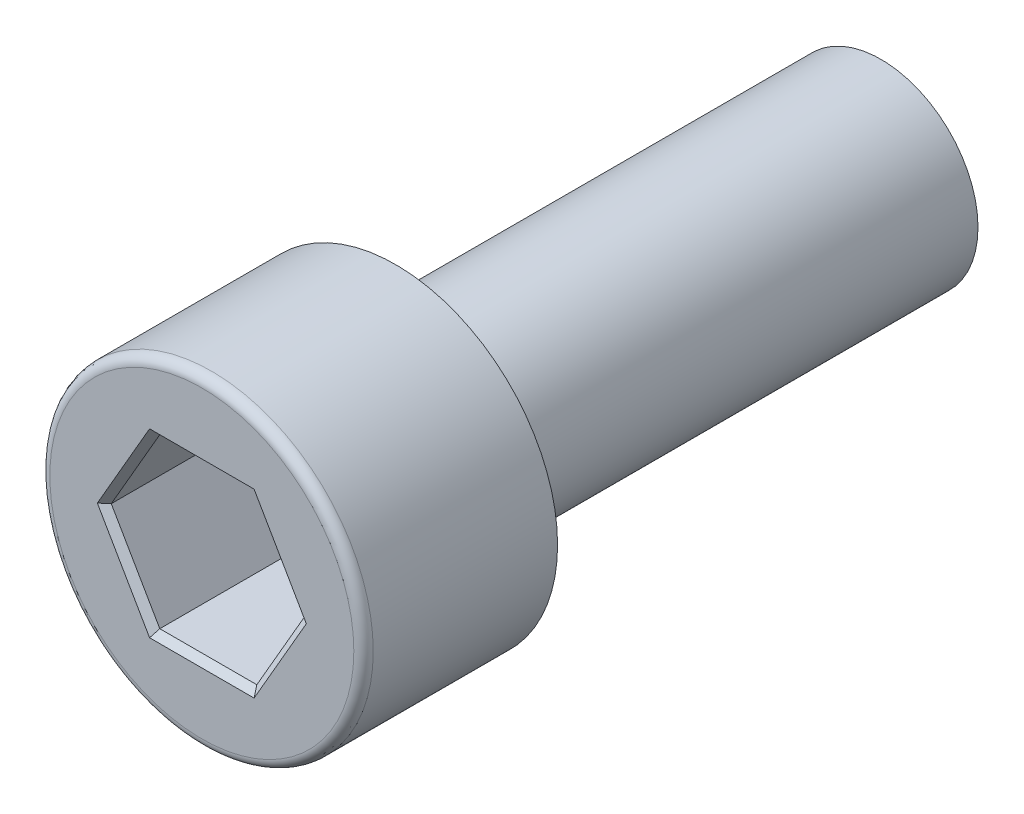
ISO-10303-21;
HEADER;
FILE_DESCRIPTION(('STEP AP214'),'2;1');
FILE_NAME('part.step','',(''),(''),'','','');
FILE_SCHEMA(('AUTOMOTIVE_DESIGN { 1 0 10303 214 1 1 1 1 }'));
ENDSEC;
DATA;
#1=APPLICATION_CONTEXT('core data for automotive mechanical design processes');
#2=APPLICATION_PROTOCOL_DEFINITION('international standard','automotive_design',2000,#1);
#3=PRODUCT_CONTEXT('',#1,'mechanical');
#4=PRODUCT('Part','Part','',(#3));
#5=PRODUCT_RELATED_PRODUCT_CATEGORY('part','',(#4));
#6=PRODUCT_DEFINITION_FORMATION('','',#4);
#7=PRODUCT_DEFINITION_CONTEXT('part definition',#1,'design');
#8=PRODUCT_DEFINITION('design','',#6,#7);
#9=PRODUCT_DEFINITION_SHAPE('','',#8);
#10=(LENGTH_UNIT() NAMED_UNIT(*) SI_UNIT(.MILLI.,.METRE.));
#11=(NAMED_UNIT(*) PLANE_ANGLE_UNIT() SI_UNIT($,.RADIAN.));
#12=(NAMED_UNIT(*) SI_UNIT($,.STERADIAN.) SOLID_ANGLE_UNIT());
#13=UNCERTAINTY_MEASURE_WITH_UNIT(LENGTH_MEASURE(1.E-05),#10,'distance_accuracy_value','');
#14=(GEOMETRIC_REPRESENTATION_CONTEXT(3) GLOBAL_UNCERTAINTY_ASSIGNED_CONTEXT((#13)) GLOBAL_UNIT_ASSIGNED_CONTEXT((#10,
#11,#12)) REPRESENTATION_CONTEXT('',''));
#15=CARTESIAN_POINT('',(0.,0.,0.));
#16=DIRECTION('',(0.,0.,1.));
#17=DIRECTION('',(1.,0.,0.));
#18=AXIS2_PLACEMENT_3D('',#15,#16,#17);
#19=CARTESIAN_POINT('',(0.,0.,21.));
#20=DIRECTION('',(0.,0.,1.));
#21=DIRECTION('',(1.,0.,0.));
#22=AXIS2_PLACEMENT_3D('',#19,#20,#21);
#23=PLANE('',#22);
#24=CARTESIAN_POINT('',(0.,0.,21.));
#25=DIRECTION('',(0.,0.,1.));
#26=DIRECTION('',(1.,0.,0.));
#27=AXIS2_PLACEMENT_3D('',#24,#25,#26);
#28=CIRCLE('',#27,4.7);
#29=CARTESIAN_POINT('',(4.7,0.,21.));
#30=VERTEX_POINT('',#29);
#31=EDGE_CURVE('E42',#30,#30,#28,.T.);
#32=ORIENTED_EDGE('',*,*,#31,.T.);
#33=EDGE_LOOP('',(#32));
#34=FACE_BOUND('',#33,.T.);
#35=DIRECTION('',(-0.49998194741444,0.8660358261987,0.));
#36=VECTOR('',#35,1.);
#37=CARTESIAN_POINT('',(-2.42326132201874,-1.39900322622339,21.));
#38=LINE('',#37,#36);
#39=CARTESIAN_POINT('',(-1.61558114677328,-2.798013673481,21.));
#40=VERTEX_POINT('',#39);
#41=CARTESIAN_POINT('',(-3.23093732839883,0.,21.));
#42=VERTEX_POINT('',#41);
#43=EDGE_CURVE('E161',#40,#42,#38,.T.);
#44=ORIENTED_EDGE('',*,*,#43,.T.);
#45=DIRECTION('',(0.499981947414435,0.866035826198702,0.));
#46=VECTOR('',#45,1.);
#47=CARTESIAN_POINT('',(-2.42326132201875,1.39900322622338,21.));
#48=LINE('',#47,#46);
#49=CARTESIAN_POINT('',(-1.61558114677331,2.79801367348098,21.));
#50=VERTEX_POINT('',#49);
#51=EDGE_CURVE('E171',#42,#50,#48,.T.);
#52=ORIENTED_EDGE('',*,*,#51,.T.);
#53=DIRECTION('',(1.,0.,0.));
#54=VECTOR('',#53,1.);
#55=CARTESIAN_POINT('',(0.,2.79801367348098,21.));
#56=LINE('',#55,#54);
#57=CARTESIAN_POINT('',(1.61558114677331,2.79801367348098,21.));
#58=VERTEX_POINT('',#57);
#59=EDGE_CURVE('E169',#50,#58,#56,.T.);
#60=ORIENTED_EDGE('',*,*,#59,.T.);
#61=DIRECTION('',(0.499981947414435,-0.866035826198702,0.));
#62=VECTOR('',#61,1.);
#63=CARTESIAN_POINT('',(2.42326132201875,1.39900322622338,21.));
#64=LINE('',#63,#62);
#65=CARTESIAN_POINT('',(3.23093732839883,0.,21.));
#66=VERTEX_POINT('',#65);
#67=EDGE_CURVE('E167',#58,#66,#64,.T.);
#68=ORIENTED_EDGE('',*,*,#67,.T.);
#69=DIRECTION('',(-0.499981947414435,-0.866035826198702,0.));
#70=VECTOR('',#69,1.);
#71=CARTESIAN_POINT('',(2.42326132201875,-1.39900322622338,21.));
#72=LINE('',#71,#70);
#73=CARTESIAN_POINT('',(1.61558114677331,-2.79801367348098,21.));
#74=VERTEX_POINT('',#73);
#75=EDGE_CURVE('E165',#66,#74,#72,.T.);
#76=ORIENTED_EDGE('',*,*,#75,.T.);
#77=DIRECTION('',(-1.,0.,0.));
#78=VECTOR('',#77,1.);
#79=CARTESIAN_POINT('',(0.,-2.79801367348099,21.));
#80=LINE('',#79,#78);
#81=EDGE_CURVE('E163',#74,#40,#80,.T.);
#82=ORIENTED_EDGE('',*,*,#81,.T.);
#83=EDGE_LOOP('',(#44,#52,#60,#68,#76,#82));
#84=FACE_BOUND('',#83,.T.);
#85=ADVANCED_FACE('F34',(#34,#84),#23,.T.);
#86=CARTESIAN_POINT('',(0.,0.,15.));
#87=DIRECTION('',(0.,0.,-1.));
#88=DIRECTION('',(-1.,0.,0.));
#89=AXIS2_PLACEMENT_3D('',#86,#87,#88);
#90=CYLINDRICAL_SURFACE('',#89,3.);
#91=CARTESIAN_POINT('',(0.,0.,15.));
#92=DIRECTION('',(0.,0.,1.));
#93=DIRECTION('',(1.,0.,0.));
#94=AXIS2_PLACEMENT_3D('',#91,#92,#93);
#95=CIRCLE('',#94,3.);
#96=CARTESIAN_POINT('',(3.,0.,15.));
#97=VERTEX_POINT('',#96);
#98=EDGE_CURVE('E158',#97,#97,#95,.T.);
#99=ORIENTED_EDGE('',*,*,#98,.F.);
#100=EDGE_LOOP('',(#99));
#101=FACE_BOUND('',#100,.T.);
#102=CARTESIAN_POINT('',(0.,0.,0.));
#103=DIRECTION('',(0.,0.,1.));
#104=DIRECTION('',(1.,0.,0.));
#105=AXIS2_PLACEMENT_3D('',#102,#103,#104);
#106=CIRCLE('',#105,3.);
#107=CARTESIAN_POINT('',(3.,0.,0.));
#108=VERTEX_POINT('',#107);
#109=EDGE_CURVE('E155',#108,#108,#106,.T.);
#110=ORIENTED_EDGE('',*,*,#109,.T.);
#111=EDGE_LOOP('',(#110));
#112=FACE_BOUND('',#111,.T.);
#113=ADVANCED_FACE('F36',(#101,#112),#90,.T.);
#114=CARTESIAN_POINT('',(0.,0.,0.));
#115=DIRECTION('',(0.,0.,1.));
#116=DIRECTION('',(1.,0.,0.));
#117=AXIS2_PLACEMENT_3D('',#114,#115,#116);
#118=PLANE('',#117);
#119=ORIENTED_EDGE('',*,*,#109,.F.);
#120=EDGE_LOOP('',(#119));
#121=FACE_BOUND('',#120,.T.);
#122=ADVANCED_FACE('F204',(#121),#118,.F.);
#123=CARTESIAN_POINT('',(0.,0.,15.));
#124=DIRECTION('',(0.,0.,1.));
#125=DIRECTION('',(1.,0.,0.));
#126=AXIS2_PLACEMENT_3D('',#123,#124,#125);
#127=PLANE('',#126);
#128=CARTESIAN_POINT('',(0.,0.,15.));
#129=DIRECTION('',(0.,0.,1.));
#130=DIRECTION('',(1.,0.,0.));
#131=AXIS2_PLACEMENT_3D('',#128,#129,#130);
#132=CIRCLE('',#131,5.);
#133=CARTESIAN_POINT('',(5.,0.,15.));
#134=VERTEX_POINT('',#133);
#135=EDGE_CURVE('E115',#134,#134,#132,.T.);
#136=ORIENTED_EDGE('',*,*,#135,.F.);
#137=EDGE_LOOP('',(#136));
#138=FACE_BOUND('',#137,.T.);
#139=ORIENTED_EDGE('',*,*,#98,.T.);
#140=EDGE_LOOP('',(#139));
#141=FACE_BOUND('',#140,.T.);
#142=ADVANCED_FACE('F208',(#138,#141),#127,.F.);
#143=CARTESIAN_POINT('',(0.,0.,21.));
#144=DIRECTION('',(0.,0.,-1.));
#145=DIRECTION('',(-1.,0.,0.));
#146=AXIS2_PLACEMENT_3D('',#143,#144,#145);
#147=CYLINDRICAL_SURFACE('',#146,5.);
#148=CARTESIAN_POINT('',(0.,0.,20.7));
#149=DIRECTION('',(0.,0.,1.));
#150=DIRECTION('',(1.,0.,0.));
#151=AXIS2_PLACEMENT_3D('',#148,#149,#150);
#152=CIRCLE('',#151,5.);
#153=CARTESIAN_POINT('',(5.,0.,20.7));
#154=VERTEX_POINT('',#153);
#155=EDGE_CURVE('E11',#154,#154,#152,.F.);
#156=ORIENTED_EDGE('',*,*,#155,.T.);
#157=EDGE_LOOP('',(#156));
#158=FACE_BOUND('',#157,.T.);
#159=ORIENTED_EDGE('',*,*,#135,.T.);
#160=EDGE_LOOP('',(#159));
#161=FACE_BOUND('',#160,.T.);
#162=ADVANCED_FACE('F210',(#158,#161),#147,.T.);
#163=CARTESIAN_POINT('',(-1.50010831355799,-2.598013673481,17.));
#164=DIRECTION('',(0.8660358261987,0.49998194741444,0.));
#165=DIRECTION('',(-0.49998194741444,0.8660358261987,0.));
#166=AXIS2_PLACEMENT_3D('',#163,#164,#165);
#167=PLANE('',#166);
#168=DIRECTION('',(0.,0.,1.));
#169=VECTOR('',#168,1.);
#170=CARTESIAN_POINT('',(-3.,0.,17.));
#171=LINE('',#170,#169);
#172=CARTESIAN_POINT('',(-3.,0.,17.));
#173=VERTEX_POINT('',#172);
#174=CARTESIAN_POINT('',(-3.,0.,20.8));
#175=VERTEX_POINT('',#174);
#176=EDGE_CURVE('E106',#173,#175,#171,.T.);
#177=ORIENTED_EDGE('',*,*,#176,.T.);
#178=DIRECTION('',(0.49998194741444,-0.8660358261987,0.));
#179=VECTOR('',#178,1.);
#180=CARTESIAN_POINT('',(-1.50010831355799,-2.598013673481,20.8));
#181=LINE('',#180,#179);
#182=CARTESIAN_POINT('',(-1.50010831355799,-2.598013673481,20.8));
#183=VERTEX_POINT('',#182);
#184=EDGE_CURVE('E49',#175,#183,#181,.T.);
#185=ORIENTED_EDGE('',*,*,#184,.T.);
#186=DIRECTION('',(0.,0.,1.));
#187=VECTOR('',#186,1.);
#188=CARTESIAN_POINT('',(-1.50010831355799,-2.598013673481,17.));
#189=LINE('',#188,#187);
#190=CARTESIAN_POINT('',(-1.50010831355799,-2.598013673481,17.));
#191=VERTEX_POINT('',#190);
#192=EDGE_CURVE('E121',#191,#183,#189,.T.);
#193=ORIENTED_EDGE('',*,*,#192,.F.);
#194=DIRECTION('',(-0.49998194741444,0.8660358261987,0.));
#195=VECTOR('',#194,1.);
#196=CARTESIAN_POINT('',(-1.50010831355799,-2.598013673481,17.));
#197=LINE('',#196,#195);
#198=EDGE_CURVE('E119',#191,#173,#197,.T.);
#199=ORIENTED_EDGE('',*,*,#198,.T.);
#200=EDGE_LOOP('',(#177,#185,#193,#199));
#201=FACE_BOUND('',#200,.T.);
#202=ADVANCED_FACE('F120',(#201),#167,.T.);
#203=CARTESIAN_POINT('',(-3.,0.,17.));
#204=DIRECTION('',(0.866035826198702,-0.499981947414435,0.));
#205=DIRECTION('',(0.499981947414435,0.866035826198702,0.));
#206=AXIS2_PLACEMENT_3D('',#203,#204,#205);
#207=PLANE('',#206);
#208=DIRECTION('',(0.,0.,1.));
#209=VECTOR('',#208,1.);
#210=CARTESIAN_POINT('',(-1.50010831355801,2.59801367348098,17.));
#211=LINE('',#210,#209);
#212=CARTESIAN_POINT('',(-1.50010831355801,2.59801367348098,17.));
#213=VERTEX_POINT('',#212);
#214=CARTESIAN_POINT('',(-1.50010831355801,2.59801367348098,20.8));
#215=VERTEX_POINT('',#214);
#216=EDGE_CURVE('E116',#213,#215,#211,.T.);
#217=ORIENTED_EDGE('',*,*,#216,.T.);
#218=DIRECTION('',(-0.499981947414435,-0.866035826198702,0.));
#219=VECTOR('',#218,1.);
#220=CARTESIAN_POINT('',(-3.,0.,20.8));
#221=LINE('',#220,#219);
#222=EDGE_CURVE('E114',#215,#175,#221,.T.);
#223=ORIENTED_EDGE('',*,*,#222,.T.);
#224=ORIENTED_EDGE('',*,*,#176,.F.);
#225=DIRECTION('',(0.499981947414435,0.866035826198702,0.));
#226=VECTOR('',#225,1.);
#227=CARTESIAN_POINT('',(-3.,0.,17.));
#228=LINE('',#227,#226);
#229=EDGE_CURVE('E111',#173,#213,#228,.T.);
#230=ORIENTED_EDGE('',*,*,#229,.T.);
#231=EDGE_LOOP('',(#217,#223,#224,#230));
#232=FACE_BOUND('',#231,.T.);
#233=ADVANCED_FACE('F109',(#232),#207,.T.);
#234=CARTESIAN_POINT('',(-1.50010831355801,2.59801367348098,17.));
#235=DIRECTION('',(0.,-1.,0.));
#236=DIRECTION('',(0.,0.,-1.));
#237=AXIS2_PLACEMENT_3D('',#234,#235,#236);
#238=PLANE('',#237);
#239=DIRECTION('',(0.,0.,1.));
#240=VECTOR('',#239,1.);
#241=CARTESIAN_POINT('',(1.50010831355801,2.59801367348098,17.));
#242=LINE('',#241,#240);
#243=CARTESIAN_POINT('',(1.50010831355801,2.59801367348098,17.));
#244=VERTEX_POINT('',#243);
#245=CARTESIAN_POINT('',(1.50010831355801,2.59801367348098,20.8));
#246=VERTEX_POINT('',#245);
#247=EDGE_CURVE('E149',#244,#246,#242,.T.);
#248=ORIENTED_EDGE('',*,*,#247,.T.);
#249=DIRECTION('',(-1.,0.,0.));
#250=VECTOR('',#249,1.);
#251=CARTESIAN_POINT('',(-1.50010831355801,2.59801367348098,20.8));
#252=LINE('',#251,#250);
#253=EDGE_CURVE('E175',#246,#215,#252,.T.);
#254=ORIENTED_EDGE('',*,*,#253,.T.);
#255=ORIENTED_EDGE('',*,*,#216,.F.);
#256=DIRECTION('',(1.,0.,0.));
#257=VECTOR('',#256,1.);
#258=CARTESIAN_POINT('',(-1.50010831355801,2.59801367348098,17.));
#259=LINE('',#258,#257);
#260=EDGE_CURVE('E130',#213,#244,#259,.T.);
#261=ORIENTED_EDGE('',*,*,#260,.T.);
#262=EDGE_LOOP('',(#248,#254,#255,#261));
#263=FACE_BOUND('',#262,.T.);
#264=ADVANCED_FACE('F243',(#263),#238,.T.);
#265=CARTESIAN_POINT('',(1.50010831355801,2.59801367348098,17.));
#266=DIRECTION('',(-0.866035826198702,-0.499981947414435,0.));
#267=DIRECTION('',(0.499981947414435,-0.866035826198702,0.));
#268=AXIS2_PLACEMENT_3D('',#265,#266,#267);
#269=PLANE('',#268);
#270=DIRECTION('',(0.,0.,1.));
#271=VECTOR('',#270,1.);
#272=CARTESIAN_POINT('',(3.,0.,17.));
#273=LINE('',#272,#271);
#274=CARTESIAN_POINT('',(3.,0.,17.));
#275=VERTEX_POINT('',#274);
#276=CARTESIAN_POINT('',(3.,0.,20.8));
#277=VERTEX_POINT('',#276);
#278=EDGE_CURVE('E146',#275,#277,#273,.T.);
#279=ORIENTED_EDGE('',*,*,#278,.T.);
#280=DIRECTION('',(-0.499981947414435,0.866035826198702,0.));
#281=VECTOR('',#280,1.);
#282=CARTESIAN_POINT('',(1.50010831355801,2.59801367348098,20.8));
#283=LINE('',#282,#281);
#284=EDGE_CURVE('E177',#277,#246,#283,.T.);
#285=ORIENTED_EDGE('',*,*,#284,.T.);
#286=ORIENTED_EDGE('',*,*,#247,.F.);
#287=DIRECTION('',(0.499981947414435,-0.866035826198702,0.));
#288=VECTOR('',#287,1.);
#289=CARTESIAN_POINT('',(1.50010831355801,2.59801367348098,17.));
#290=LINE('',#289,#288);
#291=EDGE_CURVE('E132',#244,#275,#290,.T.);
#292=ORIENTED_EDGE('',*,*,#291,.T.);
#293=EDGE_LOOP('',(#279,#285,#286,#292));
#294=FACE_BOUND('',#293,.T.);
#295=ADVANCED_FACE('F249',(#294),#269,.T.);
#296=CARTESIAN_POINT('',(3.,0.,17.));
#297=DIRECTION('',(-0.866035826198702,0.499981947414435,0.));
#298=DIRECTION('',(-0.499981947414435,-0.866035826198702,0.));
#299=AXIS2_PLACEMENT_3D('',#296,#297,#298);
#300=PLANE('',#299);
#301=DIRECTION('',(0.,0.,1.));
#302=VECTOR('',#301,1.);
#303=CARTESIAN_POINT('',(1.50010831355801,-2.59801367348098,17.));
#304=LINE('',#303,#302);
#305=CARTESIAN_POINT('',(1.50010831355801,-2.59801367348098,17.));
#306=VERTEX_POINT('',#305);
#307=CARTESIAN_POINT('',(1.50010831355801,-2.59801367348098,20.8));
#308=VERTEX_POINT('',#307);
#309=EDGE_CURVE('E144',#306,#308,#304,.T.);
#310=ORIENTED_EDGE('',*,*,#309,.T.);
#311=DIRECTION('',(0.499981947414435,0.866035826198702,0.));
#312=VECTOR('',#311,1.);
#313=CARTESIAN_POINT('',(3.,0.,20.8));
#314=LINE('',#313,#312);
#315=EDGE_CURVE('E179',#308,#277,#314,.T.);
#316=ORIENTED_EDGE('',*,*,#315,.T.);
#317=ORIENTED_EDGE('',*,*,#278,.F.);
#318=DIRECTION('',(-0.499981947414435,-0.866035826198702,0.));
#319=VECTOR('',#318,1.);
#320=CARTESIAN_POINT('',(3.,0.,17.));
#321=LINE('',#320,#319);
#322=EDGE_CURVE('E138',#275,#306,#321,.T.);
#323=ORIENTED_EDGE('',*,*,#322,.T.);
#324=EDGE_LOOP('',(#310,#316,#317,#323));
#325=FACE_BOUND('',#324,.T.);
#326=ADVANCED_FACE('F257',(#325),#300,.T.);
#327=CARTESIAN_POINT('',(1.50010831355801,-2.59801367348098,17.));
#328=DIRECTION('',(0.,1.,0.));
#329=DIRECTION('',(-1.,0.,0.));
#330=AXIS2_PLACEMENT_3D('',#327,#328,#329);
#331=PLANE('',#330);
#332=ORIENTED_EDGE('',*,*,#192,.T.);
#333=DIRECTION('',(1.,0.,0.));
#334=VECTOR('',#333,1.);
#335=CARTESIAN_POINT('',(1.50010831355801,-2.59801367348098,20.8));
#336=LINE('',#335,#334);
#337=EDGE_CURVE('E56',#183,#308,#336,.T.);
#338=ORIENTED_EDGE('',*,*,#337,.T.);
#339=ORIENTED_EDGE('',*,*,#309,.F.);
#340=DIRECTION('',(-1.,0.,0.));
#341=VECTOR('',#340,1.);
#342=CARTESIAN_POINT('',(1.50010831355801,-2.59801367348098,17.));
#343=LINE('',#342,#341);
#344=EDGE_CURVE('E141',#306,#191,#343,.T.);
#345=ORIENTED_EDGE('',*,*,#344,.T.);
#346=EDGE_LOOP('',(#332,#338,#339,#345));
#347=FACE_BOUND('',#346,.T.);
#348=ADVANCED_FACE('F265',(#347),#331,.T.);
#349=CARTESIAN_POINT('',(-1.50010831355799,-2.598013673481,17.));
#350=DIRECTION('',(0.,0.,1.));
#351=DIRECTION('',(1.,0.,0.));
#352=AXIS2_PLACEMENT_3D('',#349,#350,#351);
#353=PLANE('',#352);
#354=ORIENTED_EDGE('',*,*,#198,.F.);
#355=ORIENTED_EDGE('',*,*,#344,.F.);
#356=ORIENTED_EDGE('',*,*,#322,.F.);
#357=ORIENTED_EDGE('',*,*,#291,.F.);
#358=ORIENTED_EDGE('',*,*,#260,.F.);
#359=ORIENTED_EDGE('',*,*,#229,.F.);
#360=EDGE_LOOP('',(#354,#355,#356,#357,#358,#359));
#361=FACE_BOUND('',#360,.T.);
#362=ADVANCED_FACE('F127',(#361),#353,.T.);
#363=CARTESIAN_POINT('',(2.42326132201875,-1.39900322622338,21.));
#364=DIRECTION('',(0.612379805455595,-0.353540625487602,-0.70710678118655));
#365=DIRECTION('',(-0.755925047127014,0.,-0.654658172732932));
#366=AXIS2_PLACEMENT_3D('',#363,#364,#365);
#367=PLANE('',#366);
#368=DIRECTION('',(-0.755925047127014,0.,-0.654658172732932));
#369=VECTOR('',#368,1.);
#370=CARTESIAN_POINT('',(2.76941294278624,0.,20.6003033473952));
#371=LINE('',#370,#369);
#372=EDGE_CURVE('E384',#277,#66,#371,.F.);
#373=ORIENTED_EDGE('',*,*,#372,.F.);
#374=ORIENTED_EDGE('',*,*,#315,.F.);
#375=DIRECTION('',(-0.377972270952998,0.654651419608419,-0.654651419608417));
#376=VECTOR('',#375,1.);
#377=CARTESIAN_POINT('',(1.3847975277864,-2.39829434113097,20.60028066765));
#378=LINE('',#377,#376);
#379=EDGE_CURVE('E125',#74,#308,#378,.T.);
#380=ORIENTED_EDGE('',*,*,#379,.F.);
#381=ORIENTED_EDGE('',*,*,#75,.F.);
#382=EDGE_LOOP('',(#373,#374,#380,#381));
#383=FACE_BOUND('',#382,.T.);
#384=ADVANCED_FACE('F274',(#383),#367,.F.);
#385=CARTESIAN_POINT('',(0.,-2.79801367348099,21.));
#386=DIRECTION('',(0.,-0.707106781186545,-0.70710678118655));
#387=DIRECTION('',(0.,0.70710678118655,-0.707106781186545));
#388=AXIS2_PLACEMENT_3D('',#385,#386,#387);
#389=PLANE('',#388);
#390=ORIENTED_EDGE('',*,*,#379,.T.);
#391=ORIENTED_EDGE('',*,*,#337,.F.);
#392=DIRECTION('',(0.377972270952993,0.654651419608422,-0.654651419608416));
#393=VECTOR('',#392,1.);
#394=CARTESIAN_POINT('',(-1.38477431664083,-2.39825413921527,20.6002404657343));
#395=LINE('',#394,#393);
#396=EDGE_CURVE('E380',#40,#183,#395,.T.);
#397=ORIENTED_EDGE('',*,*,#396,.F.);
#398=ORIENTED_EDGE('',*,*,#81,.F.);
#399=EDGE_LOOP('',(#390,#391,#397,#398));
#400=FACE_BOUND('',#399,.T.);
#401=ADVANCED_FACE('F286',(#400),#389,.F.);
#402=CARTESIAN_POINT('',(2.42326132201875,1.39900322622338,21.));
#403=DIRECTION('',(0.612379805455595,0.353540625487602,-0.70710678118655));
#404=DIRECTION('',(-0.755925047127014,0.,-0.654658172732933));
#405=AXIS2_PLACEMENT_3D('',#402,#403,#404);
#406=PLANE('',#405);
#407=ORIENTED_EDGE('',*,*,#372,.T.);
#408=ORIENTED_EDGE('',*,*,#67,.F.);
#409=DIRECTION('',(-0.377972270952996,-0.654651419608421,-0.654651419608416));
#410=VECTOR('',#409,1.);
#411=CARTESIAN_POINT('',(1.38477431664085,2.39825413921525,20.6002404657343));
#412=LINE('',#411,#410);
#413=EDGE_CURVE('E376',#246,#58,#412,.F.);
#414=ORIENTED_EDGE('',*,*,#413,.F.);
#415=ORIENTED_EDGE('',*,*,#284,.F.);
#416=EDGE_LOOP('',(#407,#408,#414,#415));
#417=FACE_BOUND('',#416,.T.);
#418=ADVANCED_FACE('F294',(#417),#406,.F.);
#419=CARTESIAN_POINT('',(-2.42326132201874,-1.39900322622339,21.));
#420=DIRECTION('',(-0.612379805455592,-0.353540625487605,-0.70710678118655));
#421=DIRECTION('',(-0.755925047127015,0.,0.654658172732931));
#422=AXIS2_PLACEMENT_3D('',#419,#420,#421);
#423=PLANE('',#422);
#424=ORIENTED_EDGE('',*,*,#396,.T.);
#425=ORIENTED_EDGE('',*,*,#184,.F.);
#426=DIRECTION('',(-0.755925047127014,0.,0.654658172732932));
#427=VECTOR('',#426,1.);
#428=CARTESIAN_POINT('',(-2.76941294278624,0.,20.6003033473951));
#429=LINE('',#428,#427);
#430=EDGE_CURVE('E381',#42,#175,#429,.F.);
#431=ORIENTED_EDGE('',*,*,#430,.F.);
#432=ORIENTED_EDGE('',*,*,#43,.F.);
#433=EDGE_LOOP('',(#424,#425,#431,#432));
#434=FACE_BOUND('',#433,.T.);
#435=ADVANCED_FACE('F302',(#434),#423,.F.);
#436=CARTESIAN_POINT('',(0.,2.79801367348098,21.));
#437=DIRECTION('',(0.,0.707106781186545,-0.70710678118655));
#438=DIRECTION('',(0.,0.70710678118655,0.707106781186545));
#439=AXIS2_PLACEMENT_3D('',#436,#437,#438);
#440=PLANE('',#439);
#441=ORIENTED_EDGE('',*,*,#413,.T.);
#442=ORIENTED_EDGE('',*,*,#59,.F.);
#443=DIRECTION('',(0.377972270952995,-0.654651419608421,-0.654651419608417));
#444=VECTOR('',#443,1.);
#445=CARTESIAN_POINT('',(-1.3847975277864,2.39829434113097,20.60028066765));
#446=LINE('',#445,#444);
#447=EDGE_CURVE('E386',#215,#50,#446,.F.);
#448=ORIENTED_EDGE('',*,*,#447,.F.);
#449=ORIENTED_EDGE('',*,*,#253,.F.);
#450=EDGE_LOOP('',(#441,#442,#448,#449));
#451=FACE_BOUND('',#450,.T.);
#452=ADVANCED_FACE('F195',(#451),#440,.F.);
#453=CARTESIAN_POINT('',(-2.42326132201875,1.39900322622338,21.));
#454=DIRECTION('',(-0.612379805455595,0.353540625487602,-0.707106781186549));
#455=DIRECTION('',(-0.755925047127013,0.,0.654658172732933));
#456=AXIS2_PLACEMENT_3D('',#453,#454,#455);
#457=PLANE('',#456);
#458=ORIENTED_EDGE('',*,*,#430,.T.);
#459=ORIENTED_EDGE('',*,*,#222,.F.);
#460=ORIENTED_EDGE('',*,*,#447,.T.);
#461=ORIENTED_EDGE('',*,*,#51,.F.);
#462=EDGE_LOOP('',(#458,#459,#460,#461));
#463=FACE_BOUND('',#462,.T.);
#464=ADVANCED_FACE('F189',(#463),#457,.F.);
#465=CARTESIAN_POINT('',(0.,0.,20.7));
#466=DIRECTION('',(0.,0.,1.));
#467=DIRECTION('',(1.,0.,0.));
#468=AXIS2_PLACEMENT_3D('',#465,#466,#467);
#469=TOROIDAL_SURFACE('',#468,4.7,0.3);
#470=ORIENTED_EDGE('',*,*,#155,.F.);
#471=EDGE_LOOP('',(#470));
#472=FACE_BOUND('',#471,.T.);
#473=ORIENTED_EDGE('',*,*,#31,.F.);
#474=EDGE_LOOP('',(#473));
#475=FACE_BOUND('',#474,.T.);
#476=ADVANCED_FACE('F187',(#472,#475),#469,.T.);
#477=CLOSED_SHELL('',(#85,#113,#122,#142,#162,#202,#233,#264,#295,#326,#348,#362,#384,#401,#418,
#435,#452,#464,#476));
#478=MANIFOLD_SOLID_BREP('B2',#477);
#479=ADVANCED_BREP_SHAPE_REPRESENTATION('',(#18,#478),#14);
#480=SHAPE_DEFINITION_REPRESENTATION(#9,#479);
ENDSEC;
END-ISO-10303-21;
